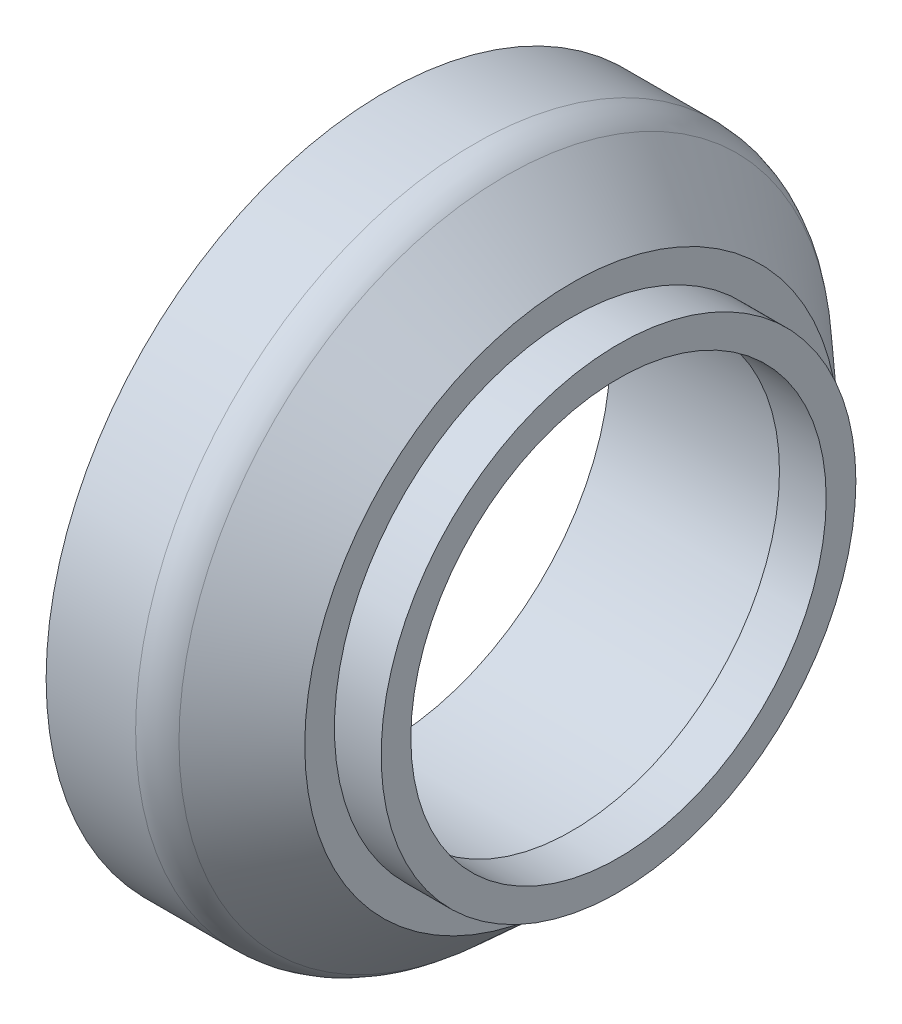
ISO-10303-21;
HEADER;
FILE_DESCRIPTION(('STEP AP214'),'2;1');
FILE_NAME('part.step','',(''),(''),'','','');
FILE_SCHEMA(('AUTOMOTIVE_DESIGN { 1 0 10303 214 1 1 1 1 }'));
ENDSEC;
DATA;
#1=APPLICATION_CONTEXT('core data for automotive mechanical design processes');
#2=APPLICATION_PROTOCOL_DEFINITION('international standard','automotive_design',2000,#1);
#3=PRODUCT_CONTEXT('',#1,'mechanical');
#4=PRODUCT('Part','Part','',(#3));
#5=PRODUCT_RELATED_PRODUCT_CATEGORY('part','',(#4));
#6=PRODUCT_DEFINITION_FORMATION('','',#4);
#7=PRODUCT_DEFINITION_CONTEXT('part definition',#1,'design');
#8=PRODUCT_DEFINITION('design','',#6,#7);
#9=PRODUCT_DEFINITION_SHAPE('','',#8);
#10=(LENGTH_UNIT() NAMED_UNIT(*) SI_UNIT(.MILLI.,.METRE.));
#11=(NAMED_UNIT(*) PLANE_ANGLE_UNIT() SI_UNIT($,.RADIAN.));
#12=(NAMED_UNIT(*) SI_UNIT($,.STERADIAN.) SOLID_ANGLE_UNIT());
#13=UNCERTAINTY_MEASURE_WITH_UNIT(LENGTH_MEASURE(1.E-05),#10,'distance_accuracy_value','');
#14=(GEOMETRIC_REPRESENTATION_CONTEXT(3) GLOBAL_UNCERTAINTY_ASSIGNED_CONTEXT((#13)) GLOBAL_UNIT_ASSIGNED_CONTEXT((#10,
#11,#12)) REPRESENTATION_CONTEXT('',''));
#15=CARTESIAN_POINT('',(0.,0.,0.));
#16=DIRECTION('',(0.,0.,1.));
#17=DIRECTION('',(1.,0.,0.));
#18=AXIS2_PLACEMENT_3D('',#15,#16,#17);
#19=CARTESIAN_POINT('',(0.,72.5,0.));
#20=DIRECTION('',(1.,0.,0.));
#21=DIRECTION('',(0.,0.,-1.));
#22=AXIS2_PLACEMENT_3D('',#19,#20,#21);
#23=PLANE('',#22);
#24=CARTESIAN_POINT('',(0.,54.1265877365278,31.2499999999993));
#25=DIRECTION('',(1.,0.,0.));
#26=DIRECTION('',(0.,0.,-1.));
#27=AXIS2_PLACEMENT_3D('',#24,#25,#26);
#28=CIRCLE('',#27,6.35000000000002);
#29=CARTESIAN_POINT('',(0.,54.1265877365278,24.8999999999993));
#30=VERTEX_POINT('',#29);
#31=EDGE_CURVE('E10',#30,#30,#28,.T.);
#32=ORIENTED_EDGE('',*,*,#31,.T.);
#33=EDGE_LOOP('',(#32));
#34=FACE_BOUND('',#33,.T.);
#35=CARTESIAN_POINT('',(0.,31.2500000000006,54.126587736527));
#36=DIRECTION('',(1.,0.,0.));
#37=DIRECTION('',(0.,0.,-1.));
#38=AXIS2_PLACEMENT_3D('',#35,#36,#37);
#39=CIRCLE('',#38,6.35);
#40=CARTESIAN_POINT('',(0.,31.2500000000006,47.776587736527));
#41=VERTEX_POINT('',#40);
#42=EDGE_CURVE('E51',#41,#41,#39,.T.);
#43=ORIENTED_EDGE('',*,*,#42,.T.);
#44=EDGE_LOOP('',(#43));
#45=FACE_BOUND('',#44,.T.);
#46=CARTESIAN_POINT('',(0.,6.54652751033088E-13,62.5));
#47=DIRECTION('',(1.,0.,0.));
#48=DIRECTION('',(0.,0.,-1.));
#49=AXIS2_PLACEMENT_3D('',#46,#47,#48);
#50=CIRCLE('',#49,6.35000000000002);
#51=CARTESIAN_POINT('',(0.,6.54652751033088E-13,56.15));
#52=VERTEX_POINT('',#51);
#53=EDGE_CURVE('E58',#52,#52,#50,.T.);
#54=ORIENTED_EDGE('',*,*,#53,.T.);
#55=EDGE_LOOP('',(#54));
#56=FACE_BOUND('',#55,.T.);
#57=CARTESIAN_POINT('',(0.,-31.2499999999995,54.1265877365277));
#58=DIRECTION('',(1.,0.,0.));
#59=DIRECTION('',(0.,0.,-1.));
#60=AXIS2_PLACEMENT_3D('',#57,#58,#59);
#61=CIRCLE('',#60,6.34999999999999);
#62=CARTESIAN_POINT('',(0.,-31.2499999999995,47.7765877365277));
#63=VERTEX_POINT('',#62);
#64=EDGE_CURVE('E66',#63,#63,#61,.T.);
#65=ORIENTED_EDGE('',*,*,#64,.T.);
#66=EDGE_LOOP('',(#65));
#67=FACE_BOUND('',#66,.T.);
#68=CARTESIAN_POINT('',(0.,-54.1265877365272,31.2500000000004));
#69=DIRECTION('',(1.,0.,0.));
#70=DIRECTION('',(0.,0.,-1.));
#71=AXIS2_PLACEMENT_3D('',#68,#69,#70);
#72=CIRCLE('',#71,6.34999999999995);
#73=CARTESIAN_POINT('',(0.,-54.1265877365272,24.9000000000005));
#74=VERTEX_POINT('',#73);
#75=EDGE_CURVE('E75',#74,#74,#72,.T.);
#76=ORIENTED_EDGE('',*,*,#75,.T.);
#77=EDGE_LOOP('',(#76));
#78=FACE_BOUND('',#77,.T.);
#79=CARTESIAN_POINT('',(0.,-62.5,0.));
#80=DIRECTION('',(1.,0.,0.));
#81=DIRECTION('',(0.,0.,-1.));
#82=AXIS2_PLACEMENT_3D('',#79,#80,#81);
#83=CIRCLE('',#82,6.35000000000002);
#84=CARTESIAN_POINT('',(0.,-62.5,-6.35000000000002));
#85=VERTEX_POINT('',#84);
#86=EDGE_CURVE('E77',#85,#85,#83,.T.);
#87=ORIENTED_EDGE('',*,*,#86,.T.);
#88=EDGE_LOOP('',(#87));
#89=FACE_BOUND('',#88,.T.);
#90=CARTESIAN_POINT('',(0.,-54.1265877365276,-31.2499999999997));
#91=DIRECTION('',(1.,0.,0.));
#92=DIRECTION('',(0.,0.,-1.));
#93=AXIS2_PLACEMENT_3D('',#90,#91,#92);
#94=CIRCLE('',#93,6.35000000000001);
#95=CARTESIAN_POINT('',(0.,-54.1265877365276,-37.5999999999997));
#96=VERTEX_POINT('',#95);
#97=EDGE_CURVE('E82',#96,#96,#94,.T.);
#98=ORIENTED_EDGE('',*,*,#97,.T.);
#99=EDGE_LOOP('',(#98));
#100=FACE_BOUND('',#99,.T.);
#101=CARTESIAN_POINT('',(0.,-31.2500000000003,-54.1265877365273));
#102=DIRECTION('',(1.,0.,0.));
#103=DIRECTION('',(0.,0.,-1.));
#104=AXIS2_PLACEMENT_3D('',#101,#102,#103);
#105=CIRCLE('',#104,6.34999999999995);
#106=CARTESIAN_POINT('',(0.,-31.2500000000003,-60.4765877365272));
#107=VERTEX_POINT('',#106);
#108=EDGE_CURVE('E89',#107,#107,#105,.T.);
#109=ORIENTED_EDGE('',*,*,#108,.T.);
#110=EDGE_LOOP('',(#109));
#111=FACE_BOUND('',#110,.T.);
#112=CARTESIAN_POINT('',(0.,-2.18217583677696E-13,-62.5));
#113=DIRECTION('',(1.,0.,0.));
#114=DIRECTION('',(0.,0.,-1.));
#115=AXIS2_PLACEMENT_3D('',#112,#113,#114);
#116=CIRCLE('',#115,6.35000000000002);
#117=CARTESIAN_POINT('',(0.,-2.18217583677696E-13,-68.85));
#118=VERTEX_POINT('',#117);
#119=EDGE_CURVE('E96',#118,#118,#116,.T.);
#120=ORIENTED_EDGE('',*,*,#119,.T.);
#121=EDGE_LOOP('',(#120));
#122=FACE_BOUND('',#121,.T.);
#123=CARTESIAN_POINT('',(0.,31.2499999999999,-54.1265877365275));
#124=DIRECTION('',(1.,0.,0.));
#125=DIRECTION('',(0.,0.,-1.));
#126=AXIS2_PLACEMENT_3D('',#123,#124,#125);
#127=CIRCLE('',#126,6.34999999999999);
#128=CARTESIAN_POINT('',(0.,31.2499999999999,-60.4765877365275));
#129=VERTEX_POINT('',#128);
#130=EDGE_CURVE('E105',#129,#129,#127,.T.);
#131=ORIENTED_EDGE('',*,*,#130,.T.);
#132=EDGE_LOOP('',(#131));
#133=FACE_BOUND('',#132,.T.);
#134=CARTESIAN_POINT('',(0.,54.1265877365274,-31.2500000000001));
#135=DIRECTION('',(1.,0.,0.));
#136=DIRECTION('',(0.,0.,-1.));
#137=AXIS2_PLACEMENT_3D('',#134,#135,#136);
#138=CIRCLE('',#137,6.35000000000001);
#139=CARTESIAN_POINT('',(0.,54.1265877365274,-37.6000000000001));
#140=VERTEX_POINT('',#139);
#141=EDGE_CURVE('E107',#140,#140,#138,.T.);
#142=ORIENTED_EDGE('',*,*,#141,.T.);
#143=EDGE_LOOP('',(#142));
#144=FACE_BOUND('',#143,.T.);
#145=CARTESIAN_POINT('',(0.,62.5,0.));
#146=DIRECTION('',(1.,0.,0.));
#147=DIRECTION('',(0.,0.,-1.));
#148=AXIS2_PLACEMENT_3D('',#145,#146,#147);
#149=CIRCLE('',#148,6.35000000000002);
#150=CARTESIAN_POINT('',(0.,62.5,-6.35000000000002));
#151=VERTEX_POINT('',#150);
#152=EDGE_CURVE('E111',#151,#151,#149,.T.);
#153=ORIENTED_EDGE('',*,*,#152,.T.);
#154=EDGE_LOOP('',(#153));
#155=FACE_BOUND('',#154,.T.);
#156=CARTESIAN_POINT('',(0.,0.,0.));
#157=DIRECTION('',(-1.,0.,0.));
#158=DIRECTION('',(0.,0.,1.));
#159=AXIS2_PLACEMENT_3D('',#156,#157,#158);
#160=CIRCLE('',#159,48.25);
#161=CARTESIAN_POINT('',(0.,0.,48.25));
#162=VERTEX_POINT('',#161);
#163=EDGE_CURVE('E130',#162,#162,#160,.T.);
#164=ORIENTED_EDGE('',*,*,#163,.F.);
#165=EDGE_LOOP('',(#164));
#166=FACE_BOUND('',#165,.T.);
#167=CARTESIAN_POINT('',(0.,0.,0.));
#168=DIRECTION('',(-1.,0.,0.));
#169=DIRECTION('',(0.,0.,1.));
#170=AXIS2_PLACEMENT_3D('',#167,#168,#169);
#171=CIRCLE('',#170,72.5);
#172=CARTESIAN_POINT('',(0.,0.,72.5));
#173=VERTEX_POINT('',#172);
#174=EDGE_CURVE('E136',#173,#173,#171,.T.);
#175=ORIENTED_EDGE('',*,*,#174,.T.);
#176=EDGE_LOOP('',(#175));
#177=FACE_BOUND('',#176,.T.);
#178=ADVANCED_FACE('F39',(#34,#45,#56,#67,#78,#89,#100,#111,#122,#133,#144,#155,#166,#177),#23,.F.);
#179=CARTESIAN_POINT('',(0.,0.,0.));
#180=DIRECTION('',(-1.,0.,0.));
#181=DIRECTION('',(0.,0.,1.));
#182=AXIS2_PLACEMENT_3D('',#179,#180,#181);
#183=CYLINDRICAL_SURFACE('',#182,48.25);
#184=CARTESIAN_POINT('',(40.,0.,0.));
#185=DIRECTION('',(-1.,0.,0.));
#186=DIRECTION('',(0.,0.,1.));
#187=AXIS2_PLACEMENT_3D('',#184,#185,#186);
#188=CIRCLE('',#187,48.25);
#189=CARTESIAN_POINT('',(40.,0.,48.25));
#190=VERTEX_POINT('',#189);
#191=EDGE_CURVE('E128',#190,#190,#188,.T.);
#192=ORIENTED_EDGE('',*,*,#191,.F.);
#193=EDGE_LOOP('',(#192));
#194=FACE_BOUND('',#193,.T.);
#195=ORIENTED_EDGE('',*,*,#163,.T.);
#196=EDGE_LOOP('',(#195));
#197=FACE_BOUND('',#196,.T.);
#198=ADVANCED_FACE('F204',(#194,#197),#183,.F.);
#199=CARTESIAN_POINT('',(40.,48.25,0.));
#200=DIRECTION('',(-1.,0.,0.));
#201=DIRECTION('',(0.,0.,1.));
#202=AXIS2_PLACEMENT_3D('',#199,#200,#201);
#203=PLANE('',#202);
#204=CARTESIAN_POINT('',(40.,0.,0.));
#205=DIRECTION('',(1.,0.,0.));
#206=DIRECTION('',(0.,0.,-1.));
#207=AXIS2_PLACEMENT_3D('',#204,#205,#206);
#208=CIRCLE('',#207,50.8);
#209=CARTESIAN_POINT('',(40.,0.,-50.8));
#210=VERTEX_POINT('',#209);
#211=EDGE_CURVE('E119',#210,#210,#208,.T.);
#212=ORIENTED_EDGE('',*,*,#211,.F.);
#213=EDGE_LOOP('',(#212));
#214=FACE_BOUND('',#213,.T.);
#215=CARTESIAN_POINT('',(40.,0.,0.));
#216=DIRECTION('',(-1.,0.,0.));
#217=DIRECTION('',(0.,0.,1.));
#218=AXIS2_PLACEMENT_3D('',#215,#216,#217);
#219=CIRCLE('',#218,57.15);
#220=CARTESIAN_POINT('',(40.,0.,57.15));
#221=VERTEX_POINT('',#220);
#222=EDGE_CURVE('E132',#221,#221,#219,.T.);
#223=ORIENTED_EDGE('',*,*,#222,.F.);
#224=EDGE_LOOP('',(#223));
#225=FACE_BOUND('',#224,.T.);
#226=ADVANCED_FACE('F211',(#214,#225),#203,.F.);
#227=CARTESIAN_POINT('',(40.,0.,0.));
#228=DIRECTION('',(-1.,0.,0.));
#229=DIRECTION('',(0.,0.,1.));
#230=AXIS2_PLACEMENT_3D('',#227,#228,#229);
#231=CONICAL_SURFACE('',#230,57.15,0.73443768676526);
#232=CARTESIAN_POINT('',(25.8550285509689,0.,0.));
#233=DIRECTION('',(1.,0.,0.));
#234=DIRECTION('',(0.,0.,-1.));
#235=AXIS2_PLACEMENT_3D('',#232,#233,#234);
#236=CIRCLE('',#235,69.922077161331);
#237=CARTESIAN_POINT('',(25.8550285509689,0.,-69.922077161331));
#238=VERTEX_POINT('',#237);
#239=EDGE_CURVE('E121',#238,#238,#236,.T.);
#240=ORIENTED_EDGE('',*,*,#239,.T.);
#241=EDGE_LOOP('',(#240));
#242=FACE_BOUND('',#241,.T.);
#243=ORIENTED_EDGE('',*,*,#222,.T.);
#244=EDGE_LOOP('',(#243));
#245=FACE_BOUND('',#244,.T.);
#246=ADVANCED_FACE('F334',(#242,#245),#231,.T.);
#247=CARTESIAN_POINT('',(0.,0.,0.));
#248=DIRECTION('',(-1.,0.,0.));
#249=DIRECTION('',(0.,0.,1.));
#250=AXIS2_PLACEMENT_3D('',#247,#248,#249);
#251=CYLINDRICAL_SURFACE('',#250,72.5);
#252=CARTESIAN_POINT('',(19.1533294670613,0.,0.));
#253=DIRECTION('',(1.,0.,0.));
#254=DIRECTION('',(0.,0.,-1.));
#255=AXIS2_PLACEMENT_3D('',#252,#253,#254);
#256=CIRCLE('',#255,72.5);
#257=CARTESIAN_POINT('',(19.1533294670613,0.,-72.5));
#258=VERTEX_POINT('',#257);
#259=EDGE_CURVE('E122',#258,#258,#256,.F.);
#260=ORIENTED_EDGE('',*,*,#259,.T.);
#261=EDGE_LOOP('',(#260));
#262=FACE_BOUND('',#261,.T.);
#263=ORIENTED_EDGE('',*,*,#174,.F.);
#264=EDGE_LOOP('',(#263));
#265=FACE_BOUND('',#264,.T.);
#266=ADVANCED_FACE('F222',(#262,#265),#251,.T.);
#267=CARTESIAN_POINT('',(19.1533294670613,0.,0.));
#268=DIRECTION('',(1.,0.,0.));
#269=DIRECTION('',(0.,0.,-1.));
#270=AXIS2_PLACEMENT_3D('',#267,#268,#269);
#271=TOROIDAL_SURFACE('',#270,62.5,10.);
#272=ORIENTED_EDGE('',*,*,#239,.F.);
#273=EDGE_LOOP('',(#272));
#274=FACE_BOUND('',#273,.T.);
#275=ORIENTED_EDGE('',*,*,#259,.F.);
#276=EDGE_LOOP('',(#275));
#277=FACE_BOUND('',#276,.T.);
#278=ADVANCED_FACE('F220',(#274,#277),#271,.T.);
#279=CARTESIAN_POINT('',(40.,0.,0.));
#280=DIRECTION('',(1.,0.,0.));
#281=DIRECTION('',(0.,0.,-1.));
#282=AXIS2_PLACEMENT_3D('',#279,#280,#281);
#283=PLANE('',#282);
#284=CARTESIAN_POINT('',(40.,0.,0.));
#285=DIRECTION('',(1.,0.,0.));
#286=DIRECTION('',(0.,0.,-1.));
#287=AXIS2_PLACEMENT_3D('',#284,#285,#286);
#288=CIRCLE('',#287,44.45);
#289=CARTESIAN_POINT('',(40.,0.,-44.45));
#290=VERTEX_POINT('',#289);
#291=EDGE_CURVE('E144',#290,#290,#288,.T.);
#292=ORIENTED_EDGE('',*,*,#291,.T.);
#293=EDGE_LOOP('',(#292));
#294=FACE_BOUND('',#293,.T.);
#295=ORIENTED_EDGE('',*,*,#191,.T.);
#296=EDGE_LOOP('',(#295));
#297=FACE_BOUND('',#296,.T.);
#298=ADVANCED_FACE('F219',(#294,#297),#283,.F.);
#299=CARTESIAN_POINT('',(50.,0.,0.));
#300=DIRECTION('',(1.,0.,0.));
#301=DIRECTION('',(0.,0.,-1.));
#302=AXIS2_PLACEMENT_3D('',#299,#300,#301);
#303=PLANE('',#302);
#304=CARTESIAN_POINT('',(50.,0.,0.));
#305=DIRECTION('',(1.,0.,0.));
#306=DIRECTION('',(0.,0.,-1.));
#307=AXIS2_PLACEMENT_3D('',#304,#305,#306);
#308=CIRCLE('',#307,50.8);
#309=CARTESIAN_POINT('',(50.,0.,-50.8));
#310=VERTEX_POINT('',#309);
#311=EDGE_CURVE('E137',#310,#310,#308,.T.);
#312=ORIENTED_EDGE('',*,*,#311,.T.);
#313=EDGE_LOOP('',(#312));
#314=FACE_BOUND('',#313,.T.);
#315=CARTESIAN_POINT('',(50.,0.,0.));
#316=DIRECTION('',(1.,0.,0.));
#317=DIRECTION('',(0.,0.,-1.));
#318=AXIS2_PLACEMENT_3D('',#315,#316,#317);
#319=CIRCLE('',#318,44.45);
#320=CARTESIAN_POINT('',(50.,0.,-44.45));
#321=VERTEX_POINT('',#320);
#322=EDGE_CURVE('E145',#321,#321,#319,.T.);
#323=ORIENTED_EDGE('',*,*,#322,.F.);
#324=EDGE_LOOP('',(#323));
#325=FACE_BOUND('',#324,.T.);
#326=ADVANCED_FACE('F356',(#314,#325),#303,.T.);
#327=CARTESIAN_POINT('',(50.,0.,0.));
#328=DIRECTION('',(-1.,0.,0.));
#329=DIRECTION('',(0.,0.,1.));
#330=AXIS2_PLACEMENT_3D('',#327,#328,#329);
#331=CYLINDRICAL_SURFACE('',#330,50.8);
#332=ORIENTED_EDGE('',*,*,#311,.F.);
#333=EDGE_LOOP('',(#332));
#334=FACE_BOUND('',#333,.T.);
#335=ORIENTED_EDGE('',*,*,#211,.T.);
#336=EDGE_LOOP('',(#335));
#337=FACE_BOUND('',#336,.T.);
#338=ADVANCED_FACE('F345',(#334,#337),#331,.T.);
#339=CARTESIAN_POINT('',(50.,0.,0.));
#340=DIRECTION('',(-1.,0.,0.));
#341=DIRECTION('',(0.,0.,1.));
#342=AXIS2_PLACEMENT_3D('',#339,#340,#341);
#343=CYLINDRICAL_SURFACE('',#342,44.45);
#344=ORIENTED_EDGE('',*,*,#322,.T.);
#345=EDGE_LOOP('',(#344));
#346=FACE_BOUND('',#345,.T.);
#347=ORIENTED_EDGE('',*,*,#291,.F.);
#348=EDGE_LOOP('',(#347));
#349=FACE_BOUND('',#348,.T.);
#350=ADVANCED_FACE('F354',(#346,#349),#343,.F.);
#351=CARTESIAN_POINT('',(19.4,62.5,0.));
#352=DIRECTION('',(-1.,0.,0.));
#353=DIRECTION('',(0.,0.,1.));
#354=AXIS2_PLACEMENT_3D('',#351,#352,#353);
#355=CYLINDRICAL_SURFACE('',#354,5.35);
#356=CARTESIAN_POINT('',(0.999999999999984,62.5,0.));
#357=DIRECTION('',(1.,0.,0.));
#358=DIRECTION('',(0.,0.,-1.));
#359=AXIS2_PLACEMENT_3D('',#356,#357,#358);
#360=CIRCLE('',#359,5.35);
#361=CARTESIAN_POINT('',(0.999999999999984,62.5,-5.35));
#362=VERTEX_POINT('',#361);
#363=EDGE_CURVE('E120',#362,#362,#360,.F.);
#364=ORIENTED_EDGE('',*,*,#363,.T.);
#365=EDGE_LOOP('',(#364));
#366=FACE_BOUND('',#365,.T.);
#367=CARTESIAN_POINT('',(19.4,62.5,0.));
#368=DIRECTION('',(-1.,0.,0.));
#369=DIRECTION('',(0.,0.,1.));
#370=AXIS2_PLACEMENT_3D('',#367,#368,#369);
#371=CIRCLE('',#370,5.35);
#372=CARTESIAN_POINT('',(19.4,62.5,5.35));
#373=VERTEX_POINT('',#372);
#374=EDGE_CURVE('E146',#373,#373,#371,.T.);
#375=ORIENTED_EDGE('',*,*,#374,.F.);
#376=EDGE_LOOP('',(#375));
#377=FACE_BOUND('',#376,.T.);
#378=ADVANCED_FACE('F362',(#366,#377),#355,.F.);
#379=CARTESIAN_POINT('',(19.4,62.5,0.));
#380=DIRECTION('',(-1.,0.,0.));
#381=DIRECTION('',(0.,0.,1.));
#382=AXIS2_PLACEMENT_3D('',#379,#380,#381);
#383=PLANE('',#382);
#384=ORIENTED_EDGE('',*,*,#374,.T.);
#385=EDGE_LOOP('',(#384));
#386=FACE_BOUND('',#385,.T.);
#387=ADVANCED_FACE('F229',(#386),#383,.T.);
#388=CARTESIAN_POINT('',(0.999999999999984,62.5,0.));
#389=DIRECTION('',(-1.,0.,0.));
#390=DIRECTION('',(0.,0.,1.));
#391=AXIS2_PLACEMENT_3D('',#388,#389,#390);
#392=CONICAL_SURFACE('',#391,5.35,0.785398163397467);
#393=ORIENTED_EDGE('',*,*,#152,.F.);
#394=EDGE_LOOP('',(#393));
#395=FACE_BOUND('',#394,.T.);
#396=ORIENTED_EDGE('',*,*,#363,.F.);
#397=EDGE_LOOP('',(#396));
#398=FACE_BOUND('',#397,.T.);
#399=ADVANCED_FACE('F221',(#395,#398),#392,.F.);
#400=CARTESIAN_POINT('',(19.4,54.1265877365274,-31.2500000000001));
#401=DIRECTION('',(-1.,0.,0.));
#402=DIRECTION('',(0.,0.,1.));
#403=AXIS2_PLACEMENT_3D('',#400,#401,#402);
#404=CYLINDRICAL_SURFACE('',#403,5.35);
#405=CARTESIAN_POINT('',(0.999999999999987,54.1265877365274,-31.2500000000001));
#406=DIRECTION('',(1.,0.,0.));
#407=DIRECTION('',(0.,0.,-1.));
#408=AXIS2_PLACEMENT_3D('',#405,#406,#407);
#409=CIRCLE('',#408,5.35);
#410=CARTESIAN_POINT('',(0.999999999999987,54.1265877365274,-36.6000000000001));
#411=VERTEX_POINT('',#410);
#412=EDGE_CURVE('E112',#411,#411,#409,.F.);
#413=ORIENTED_EDGE('',*,*,#412,.T.);
#414=EDGE_LOOP('',(#413));
#415=FACE_BOUND('',#414,.T.);
#416=CARTESIAN_POINT('',(19.4,54.1265877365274,-31.2500000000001));
#417=DIRECTION('',(-1.,0.,0.));
#418=DIRECTION('',(0.,0.500000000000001,0.866025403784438));
#419=AXIS2_PLACEMENT_3D('',#416,#417,#418);
#420=CIRCLE('',#419,5.35);
#421=CARTESIAN_POINT('',(19.4,56.8015877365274,-26.6167640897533));
#422=VERTEX_POINT('',#421);
#423=EDGE_CURVE('E153',#422,#422,#420,.T.);
#424=ORIENTED_EDGE('',*,*,#423,.F.);
#425=EDGE_LOOP('',(#424));
#426=FACE_BOUND('',#425,.T.);
#427=ADVANCED_FACE('F228',(#415,#426),#404,.F.);
#428=CARTESIAN_POINT('',(19.4,54.1265877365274,-31.2500000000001));
#429=DIRECTION('',(-1.,0.,0.));
#430=DIRECTION('',(0.,0.500000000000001,0.866025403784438));
#431=AXIS2_PLACEMENT_3D('',#428,#429,#430);
#432=PLANE('',#431);
#433=ORIENTED_EDGE('',*,*,#423,.T.);
#434=EDGE_LOOP('',(#433));
#435=FACE_BOUND('',#434,.T.);
#436=ADVANCED_FACE('F387',(#435),#432,.T.);
#437=CARTESIAN_POINT('',(19.4,54.1265877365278,31.2499999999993));
#438=DIRECTION('',(-1.,0.,0.));
#439=DIRECTION('',(0.,0.,1.));
#440=AXIS2_PLACEMENT_3D('',#437,#438,#439);
#441=CYLINDRICAL_SURFACE('',#440,5.35);
#442=CARTESIAN_POINT('',(0.999999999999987,54.1265877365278,31.2499999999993));
#443=DIRECTION('',(1.,0.,0.));
#444=DIRECTION('',(0.,0.,-1.));
#445=AXIS2_PLACEMENT_3D('',#442,#443,#444);
#446=CIRCLE('',#445,5.35);
#447=CARTESIAN_POINT('',(0.999999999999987,54.1265877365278,25.8999999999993));
#448=VERTEX_POINT('',#447);
#449=EDGE_CURVE('E50',#448,#448,#446,.F.);
#450=ORIENTED_EDGE('',*,*,#449,.T.);
#451=EDGE_LOOP('',(#450));
#452=FACE_BOUND('',#451,.T.);
#453=CARTESIAN_POINT('',(19.4,54.1265877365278,31.2499999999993));
#454=DIRECTION('',(-1.,0.,0.));
#455=DIRECTION('',(0.,-0.499999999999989,0.866025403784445));
#456=AXIS2_PLACEMENT_3D('',#453,#454,#455);
#457=CIRCLE('',#456,5.35);
#458=CARTESIAN_POINT('',(19.4,51.4515877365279,35.8832359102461));
#459=VERTEX_POINT('',#458);
#460=EDGE_CURVE('E182',#459,#459,#457,.T.);
#461=ORIENTED_EDGE('',*,*,#460,.F.);
#462=EDGE_LOOP('',(#461));
#463=FACE_BOUND('',#462,.T.);
#464=ADVANCED_FACE('F199',(#452,#463),#441,.F.);
#465=CARTESIAN_POINT('',(19.4,54.1265877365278,31.2499999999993));
#466=DIRECTION('',(-1.,0.,0.));
#467=DIRECTION('',(0.,-0.499999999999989,0.866025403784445));
#468=AXIS2_PLACEMENT_3D('',#465,#466,#467);
#469=PLANE('',#468);
#470=ORIENTED_EDGE('',*,*,#460,.T.);
#471=EDGE_LOOP('',(#470));
#472=FACE_BOUND('',#471,.T.);
#473=ADVANCED_FACE('F191',(#472),#469,.T.);
#474=CARTESIAN_POINT('',(19.4,31.2500000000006,54.126587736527));
#475=DIRECTION('',(-1.,0.,0.));
#476=DIRECTION('',(0.,0.,1.));
#477=AXIS2_PLACEMENT_3D('',#474,#475,#476);
#478=CYLINDRICAL_SURFACE('',#477,5.35);
#479=CARTESIAN_POINT('',(0.999999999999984,31.2500000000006,54.126587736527));
#480=DIRECTION('',(1.,0.,0.));
#481=DIRECTION('',(0.,0.,-1.));
#482=AXIS2_PLACEMENT_3D('',#479,#480,#481);
#483=CIRCLE('',#482,5.35);
#484=CARTESIAN_POINT('',(0.999999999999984,31.2500000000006,48.776587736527));
#485=VERTEX_POINT('',#484);
#486=EDGE_CURVE('E54',#485,#485,#483,.F.);
#487=ORIENTED_EDGE('',*,*,#486,.T.);
#488=EDGE_LOOP('',(#487));
#489=FACE_BOUND('',#488,.T.);
#490=CARTESIAN_POINT('',(19.4,31.2500000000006,54.126587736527));
#491=DIRECTION('',(-1.,0.,0.));
#492=DIRECTION('',(0.,-0.866025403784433,0.50000000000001));
#493=AXIS2_PLACEMENT_3D('',#490,#491,#492);
#494=CIRCLE('',#493,5.35);
#495=CARTESIAN_POINT('',(19.4,26.6167640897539,56.8015877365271));
#496=VERTEX_POINT('',#495);
#497=EDGE_CURVE('E161',#496,#496,#494,.T.);
#498=ORIENTED_EDGE('',*,*,#497,.F.);
#499=EDGE_LOOP('',(#498));
#500=FACE_BOUND('',#499,.T.);
#501=ADVANCED_FACE('F188',(#489,#500),#478,.F.);
#502=CARTESIAN_POINT('',(19.4,31.2500000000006,54.126587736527));
#503=DIRECTION('',(-1.,0.,0.));
#504=DIRECTION('',(0.,-0.866025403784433,0.50000000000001));
#505=AXIS2_PLACEMENT_3D('',#502,#503,#504);
#506=PLANE('',#505);
#507=ORIENTED_EDGE('',*,*,#497,.T.);
#508=EDGE_LOOP('',(#507));
#509=FACE_BOUND('',#508,.T.);
#510=ADVANCED_FACE('F190',(#509),#506,.T.);
#511=CARTESIAN_POINT('',(19.4,6.54652751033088E-13,62.5));
#512=DIRECTION('',(-1.,0.,0.));
#513=DIRECTION('',(0.,0.,1.));
#514=AXIS2_PLACEMENT_3D('',#511,#512,#513);
#515=CYLINDRICAL_SURFACE('',#514,5.35);
#516=CARTESIAN_POINT('',(0.999999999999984,6.54652751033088E-13,62.5));
#517=DIRECTION('',(1.,0.,0.));
#518=DIRECTION('',(0.,0.,-1.));
#519=AXIS2_PLACEMENT_3D('',#516,#517,#518);
#520=CIRCLE('',#519,5.35);
#521=CARTESIAN_POINT('',(0.999999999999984,6.54652751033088E-13,57.15));
#522=VERTEX_POINT('',#521);
#523=EDGE_CURVE('E62',#522,#522,#520,.F.);
#524=ORIENTED_EDGE('',*,*,#523,.T.);
#525=EDGE_LOOP('',(#524));
#526=FACE_BOUND('',#525,.T.);
#527=CARTESIAN_POINT('',(19.4,6.54652751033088E-13,62.5));
#528=DIRECTION('',(-1.,0.,0.));
#529=DIRECTION('',(0.,-1.,0.));
#530=AXIS2_PLACEMENT_3D('',#527,#528,#529);
#531=CIRCLE('',#530,5.35);
#532=CARTESIAN_POINT('',(19.4,-5.34999999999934,62.5000000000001));
#533=VERTEX_POINT('',#532);
#534=EDGE_CURVE('E160',#533,#533,#531,.T.);
#535=ORIENTED_EDGE('',*,*,#534,.F.);
#536=EDGE_LOOP('',(#535));
#537=FACE_BOUND('',#536,.T.);
#538=ADVANCED_FACE('F196',(#526,#537),#515,.F.);
#539=CARTESIAN_POINT('',(19.4,6.54652751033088E-13,62.5));
#540=DIRECTION('',(-1.,0.,0.));
#541=DIRECTION('',(0.,-1.,0.));
#542=AXIS2_PLACEMENT_3D('',#539,#540,#541);
#543=PLANE('',#542);
#544=ORIENTED_EDGE('',*,*,#534,.T.);
#545=EDGE_LOOP('',(#544));
#546=FACE_BOUND('',#545,.T.);
#547=ADVANCED_FACE('F392',(#546),#543,.T.);
#548=CARTESIAN_POINT('',(19.4,-31.2499999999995,54.1265877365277));
#549=DIRECTION('',(-1.,0.,0.));
#550=DIRECTION('',(0.,0.,1.));
#551=AXIS2_PLACEMENT_3D('',#548,#549,#550);
#552=CYLINDRICAL_SURFACE('',#551,5.35);
#553=CARTESIAN_POINT('',(0.999999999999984,-31.2499999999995,54.1265877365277));
#554=DIRECTION('',(1.,0.,0.));
#555=DIRECTION('',(0.,0.,-1.));
#556=AXIS2_PLACEMENT_3D('',#553,#554,#555);
#557=CIRCLE('',#556,5.35);
#558=CARTESIAN_POINT('',(0.999999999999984,-31.2499999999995,48.7765877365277));
#559=VERTEX_POINT('',#558);
#560=EDGE_CURVE('E67',#559,#559,#557,.F.);
#561=ORIENTED_EDGE('',*,*,#560,.T.);
#562=EDGE_LOOP('',(#561));
#563=FACE_BOUND('',#562,.T.);
#564=CARTESIAN_POINT('',(19.4,-31.2499999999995,54.1265877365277));
#565=DIRECTION('',(-1.,0.,0.));
#566=DIRECTION('',(0.,-0.866025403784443,-0.499999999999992));
#567=AXIS2_PLACEMENT_3D('',#564,#565,#566);
#568=CIRCLE('',#567,5.35);
#569=CARTESIAN_POINT('',(19.4,-35.8832359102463,51.4515877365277));
#570=VERTEX_POINT('',#569);
#571=EDGE_CURVE('E159',#570,#570,#568,.T.);
#572=ORIENTED_EDGE('',*,*,#571,.F.);
#573=EDGE_LOOP('',(#572));
#574=FACE_BOUND('',#573,.T.);
#575=ADVANCED_FACE('F400',(#563,#574),#552,.F.);
#576=CARTESIAN_POINT('',(19.4,-31.2499999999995,54.1265877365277));
#577=DIRECTION('',(-1.,0.,0.));
#578=DIRECTION('',(0.,-0.866025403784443,-0.499999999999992));
#579=AXIS2_PLACEMENT_3D('',#576,#577,#578);
#580=PLANE('',#579);
#581=ORIENTED_EDGE('',*,*,#571,.T.);
#582=EDGE_LOOP('',(#581));
#583=FACE_BOUND('',#582,.T.);
#584=ADVANCED_FACE('F402',(#583),#580,.T.);
#585=CARTESIAN_POINT('',(19.4,-54.1265877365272,31.2500000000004));
#586=DIRECTION('',(-1.,0.,0.));
#587=DIRECTION('',(0.,0.,1.));
#588=AXIS2_PLACEMENT_3D('',#585,#586,#587);
#589=CYLINDRICAL_SURFACE('',#588,5.35);
#590=CARTESIAN_POINT('',(0.999999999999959,-54.1265877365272,31.2500000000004));
#591=DIRECTION('',(1.,0.,0.));
#592=DIRECTION('',(0.,0.,-1.));
#593=AXIS2_PLACEMENT_3D('',#590,#591,#592);
#594=CIRCLE('',#593,5.35);
#595=CARTESIAN_POINT('',(0.999999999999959,-54.1265877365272,25.9000000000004));
#596=VERTEX_POINT('',#595);
#597=EDGE_CURVE('E73',#596,#596,#594,.F.);
#598=ORIENTED_EDGE('',*,*,#597,.T.);
#599=EDGE_LOOP('',(#598));
#600=FACE_BOUND('',#599,.T.);
#601=CARTESIAN_POINT('',(19.4,-54.1265877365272,31.2500000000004));
#602=DIRECTION('',(-1.,0.,0.));
#603=DIRECTION('',(0.,-0.500000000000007,-0.866025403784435));
#604=AXIS2_PLACEMENT_3D('',#601,#602,#603);
#605=CIRCLE('',#604,5.35);
#606=CARTESIAN_POINT('',(19.4,-56.8015877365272,26.6167640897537));
#607=VERTEX_POINT('',#606);
#608=EDGE_CURVE('E163',#607,#607,#605,.T.);
#609=ORIENTED_EDGE('',*,*,#608,.F.);
#610=EDGE_LOOP('',(#609));
#611=FACE_BOUND('',#610,.T.);
#612=ADVANCED_FACE('F403',(#600,#611),#589,.F.);
#613=CARTESIAN_POINT('',(19.4,-54.1265877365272,31.2500000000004));
#614=DIRECTION('',(-1.,0.,0.));
#615=DIRECTION('',(0.,-0.500000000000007,-0.866025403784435));
#616=AXIS2_PLACEMENT_3D('',#613,#614,#615);
#617=PLANE('',#616);
#618=ORIENTED_EDGE('',*,*,#608,.T.);
#619=EDGE_LOOP('',(#618));
#620=FACE_BOUND('',#619,.T.);
#621=ADVANCED_FACE('F408',(#620),#617,.T.);
#622=CARTESIAN_POINT('',(19.4,-62.5,0.));
#623=DIRECTION('',(-1.,0.,0.));
#624=DIRECTION('',(0.,0.,1.));
#625=AXIS2_PLACEMENT_3D('',#622,#623,#624);
#626=CYLINDRICAL_SURFACE('',#625,5.35);
#627=CARTESIAN_POINT('',(0.999999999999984,-62.5,0.));
#628=DIRECTION('',(1.,0.,0.));
#629=DIRECTION('',(0.,0.,-1.));
#630=AXIS2_PLACEMENT_3D('',#627,#628,#629);
#631=CIRCLE('',#630,5.35);
#632=CARTESIAN_POINT('',(0.999999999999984,-62.5,-5.35));
#633=VERTEX_POINT('',#632);
#634=EDGE_CURVE('E81',#633,#633,#631,.F.);
#635=ORIENTED_EDGE('',*,*,#634,.T.);
#636=EDGE_LOOP('',(#635));
#637=FACE_BOUND('',#636,.T.);
#638=CARTESIAN_POINT('',(19.4,-62.5,0.));
#639=DIRECTION('',(-1.,0.,0.));
#640=DIRECTION('',(0.,0.,-1.));
#641=AXIS2_PLACEMENT_3D('',#638,#639,#640);
#642=CIRCLE('',#641,5.35);
#643=CARTESIAN_POINT('',(19.4,-62.5,-5.35));
#644=VERTEX_POINT('',#643);
#645=EDGE_CURVE('E170',#644,#644,#642,.T.);
#646=ORIENTED_EDGE('',*,*,#645,.F.);
#647=EDGE_LOOP('',(#646));
#648=FACE_BOUND('',#647,.T.);
#649=ADVANCED_FACE('F413',(#637,#648),#626,.F.);
#650=CARTESIAN_POINT('',(19.4,-62.5,0.));
#651=DIRECTION('',(-1.,0.,0.));
#652=DIRECTION('',(0.,0.,-1.));
#653=AXIS2_PLACEMENT_3D('',#650,#651,#652);
#654=PLANE('',#653);
#655=ORIENTED_EDGE('',*,*,#645,.T.);
#656=EDGE_LOOP('',(#655));
#657=FACE_BOUND('',#656,.T.);
#658=ADVANCED_FACE('F417',(#657),#654,.T.);
#659=CARTESIAN_POINT('',(19.4,-54.1265877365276,-31.2499999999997));
#660=DIRECTION('',(-1.,0.,0.));
#661=DIRECTION('',(0.,0.,1.));
#662=AXIS2_PLACEMENT_3D('',#659,#660,#661);
#663=CYLINDRICAL_SURFACE('',#662,5.35);
#664=CARTESIAN_POINT('',(0.999999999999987,-54.1265877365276,-31.2499999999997));
#665=DIRECTION('',(1.,0.,0.));
#666=DIRECTION('',(0.,0.,-1.));
#667=AXIS2_PLACEMENT_3D('',#664,#665,#666);
#668=CIRCLE('',#667,5.35);
#669=CARTESIAN_POINT('',(0.999999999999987,-54.1265877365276,-36.5999999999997));
#670=VERTEX_POINT('',#669);
#671=EDGE_CURVE('E87',#670,#670,#668,.F.);
#672=ORIENTED_EDGE('',*,*,#671,.T.);
#673=EDGE_LOOP('',(#672));
#674=FACE_BOUND('',#673,.T.);
#675=CARTESIAN_POINT('',(19.4,-54.1265877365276,-31.2499999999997));
#676=DIRECTION('',(-1.,0.,0.));
#677=DIRECTION('',(0.,0.499999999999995,-0.866025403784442));
#678=AXIS2_PLACEMENT_3D('',#675,#676,#677);
#679=CIRCLE('',#678,5.35);
#680=CARTESIAN_POINT('',(19.4,-51.4515877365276,-35.8832359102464));
#681=VERTEX_POINT('',#680);
#682=EDGE_CURVE('E168',#681,#681,#679,.T.);
#683=ORIENTED_EDGE('',*,*,#682,.F.);
#684=EDGE_LOOP('',(#683));
#685=FACE_BOUND('',#684,.T.);
#686=ADVANCED_FACE('F423',(#674,#685),#663,.F.);
#687=CARTESIAN_POINT('',(19.4,-54.1265877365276,-31.2499999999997));
#688=DIRECTION('',(-1.,0.,0.));
#689=DIRECTION('',(0.,0.499999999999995,-0.866025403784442));
#690=AXIS2_PLACEMENT_3D('',#687,#688,#689);
#691=PLANE('',#690);
#692=ORIENTED_EDGE('',*,*,#682,.T.);
#693=EDGE_LOOP('',(#692));
#694=FACE_BOUND('',#693,.T.);
#695=ADVANCED_FACE('F422',(#694),#691,.T.);
#696=CARTESIAN_POINT('',(19.4,-31.2500000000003,-54.1265877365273));
#697=DIRECTION('',(-1.,0.,0.));
#698=DIRECTION('',(0.,0.,1.));
#699=AXIS2_PLACEMENT_3D('',#696,#697,#698);
#700=CYLINDRICAL_SURFACE('',#699,5.35);
#701=CARTESIAN_POINT('',(0.999999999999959,-31.2500000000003,-54.1265877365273));
#702=DIRECTION('',(1.,0.,0.));
#703=DIRECTION('',(0.,0.,-1.));
#704=AXIS2_PLACEMENT_3D('',#701,#702,#703);
#705=CIRCLE('',#704,5.35);
#706=CARTESIAN_POINT('',(0.999999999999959,-31.2500000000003,-59.4765877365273));
#707=VERTEX_POINT('',#706);
#708=EDGE_CURVE('E91',#707,#707,#705,.F.);
#709=ORIENTED_EDGE('',*,*,#708,.T.);
#710=EDGE_LOOP('',(#709));
#711=FACE_BOUND('',#710,.T.);
#712=CARTESIAN_POINT('',(19.4,-31.2500000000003,-54.1265877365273));
#713=DIRECTION('',(-1.,0.,0.));
#714=DIRECTION('',(0.,0.866025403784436,-0.500000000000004));
#715=AXIS2_PLACEMENT_3D('',#712,#713,#714);
#716=CIRCLE('',#715,5.35);
#717=CARTESIAN_POINT('',(19.4,-26.6167640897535,-56.8015877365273));
#718=VERTEX_POINT('',#717);
#719=EDGE_CURVE('E172',#718,#718,#716,.T.);
#720=ORIENTED_EDGE('',*,*,#719,.F.);
#721=EDGE_LOOP('',(#720));
#722=FACE_BOUND('',#721,.T.);
#723=ADVANCED_FACE('F427',(#711,#722),#700,.F.);
#724=CARTESIAN_POINT('',(19.4,-31.2500000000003,-54.1265877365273));
#725=DIRECTION('',(-1.,0.,0.));
#726=DIRECTION('',(0.,0.866025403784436,-0.500000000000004));
#727=AXIS2_PLACEMENT_3D('',#724,#725,#726);
#728=PLANE('',#727);
#729=ORIENTED_EDGE('',*,*,#719,.T.);
#730=EDGE_LOOP('',(#729));
#731=FACE_BOUND('',#730,.T.);
#732=ADVANCED_FACE('F433',(#731),#728,.T.);
#733=CARTESIAN_POINT('',(19.4,-2.18217583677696E-13,-62.5));
#734=DIRECTION('',(-1.,0.,0.));
#735=DIRECTION('',(0.,0.,1.));
#736=AXIS2_PLACEMENT_3D('',#733,#734,#735);
#737=CYLINDRICAL_SURFACE('',#736,5.35);
#738=CARTESIAN_POINT('',(0.999999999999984,-2.18217583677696E-13,-62.5));
#739=DIRECTION('',(1.,0.,0.));
#740=DIRECTION('',(0.,0.,-1.));
#741=AXIS2_PLACEMENT_3D('',#738,#739,#740);
#742=CIRCLE('',#741,5.35);
#743=CARTESIAN_POINT('',(0.999999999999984,-2.18217583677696E-13,-67.85));
#744=VERTEX_POINT('',#743);
#745=EDGE_CURVE('E97',#744,#744,#742,.F.);
#746=ORIENTED_EDGE('',*,*,#745,.T.);
#747=EDGE_LOOP('',(#746));
#748=FACE_BOUND('',#747,.T.);
#749=CARTESIAN_POINT('',(19.4,-2.18217583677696E-13,-62.5));
#750=DIRECTION('',(-1.,0.,0.));
#751=DIRECTION('',(0.,1.,0.));
#752=AXIS2_PLACEMENT_3D('',#749,#750,#751);
#753=CIRCLE('',#752,5.35);
#754=CARTESIAN_POINT('',(19.4,5.34999999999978,-62.5));
#755=VERTEX_POINT('',#754);
#756=EDGE_CURVE('E176',#755,#755,#753,.T.);
#757=ORIENTED_EDGE('',*,*,#756,.F.);
#758=EDGE_LOOP('',(#757));
#759=FACE_BOUND('',#758,.T.);
#760=ADVANCED_FACE('F440',(#748,#759),#737,.F.);
#761=CARTESIAN_POINT('',(19.4,-2.18217583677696E-13,-62.5));
#762=DIRECTION('',(-1.,0.,0.));
#763=DIRECTION('',(0.,1.,0.));
#764=AXIS2_PLACEMENT_3D('',#761,#762,#763);
#765=PLANE('',#764);
#766=ORIENTED_EDGE('',*,*,#756,.T.);
#767=EDGE_LOOP('',(#766));
#768=FACE_BOUND('',#767,.T.);
#769=ADVANCED_FACE('F442',(#768),#765,.T.);
#770=CARTESIAN_POINT('',(19.4,31.2499999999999,-54.1265877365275));
#771=DIRECTION('',(-1.,0.,0.));
#772=DIRECTION('',(0.,0.,1.));
#773=AXIS2_PLACEMENT_3D('',#770,#771,#772);
#774=CYLINDRICAL_SURFACE('',#773,5.35);
#775=CARTESIAN_POINT('',(0.999999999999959,31.2499999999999,-54.1265877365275));
#776=DIRECTION('',(1.,0.,0.));
#777=DIRECTION('',(0.,0.,-1.));
#778=AXIS2_PLACEMENT_3D('',#775,#776,#777);
#779=CIRCLE('',#778,5.35);
#780=CARTESIAN_POINT('',(0.999999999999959,31.2499999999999,-59.4765877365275));
#781=VERTEX_POINT('',#780);
#782=EDGE_CURVE('E104',#781,#781,#779,.F.);
#783=ORIENTED_EDGE('',*,*,#782,.T.);
#784=EDGE_LOOP('',(#783));
#785=FACE_BOUND('',#784,.T.);
#786=CARTESIAN_POINT('',(19.4,31.2499999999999,-54.1265877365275));
#787=DIRECTION('',(-1.,0.,0.));
#788=DIRECTION('',(0.,0.86602540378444,0.499999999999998));
#789=AXIS2_PLACEMENT_3D('',#786,#787,#788);
#790=CIRCLE('',#789,5.35);
#791=CARTESIAN_POINT('',(19.4,35.8832359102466,-51.4515877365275));
#792=VERTEX_POINT('',#791);
#793=EDGE_CURVE('E156',#792,#792,#790,.T.);
#794=ORIENTED_EDGE('',*,*,#793,.F.);
#795=EDGE_LOOP('',(#794));
#796=FACE_BOUND('',#795,.T.);
#797=ADVANCED_FACE('F443',(#785,#796),#774,.F.);
#798=CARTESIAN_POINT('',(19.4,31.2499999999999,-54.1265877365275));
#799=DIRECTION('',(-1.,0.,0.));
#800=DIRECTION('',(0.,0.86602540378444,0.499999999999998));
#801=AXIS2_PLACEMENT_3D('',#798,#799,#800);
#802=PLANE('',#801);
#803=ORIENTED_EDGE('',*,*,#793,.T.);
#804=EDGE_LOOP('',(#803));
#805=FACE_BOUND('',#804,.T.);
#806=ADVANCED_FACE('F239',(#805),#802,.T.);
#807=CARTESIAN_POINT('',(0.999999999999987,54.1265877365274,-31.2500000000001));
#808=DIRECTION('',(-1.,0.,0.));
#809=DIRECTION('',(0.,0.,1.));
#810=AXIS2_PLACEMENT_3D('',#807,#808,#809);
#811=CONICAL_SURFACE('',#810,5.35,0.785398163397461);
#812=ORIENTED_EDGE('',*,*,#141,.F.);
#813=EDGE_LOOP('',(#812));
#814=FACE_BOUND('',#813,.T.);
#815=ORIENTED_EDGE('',*,*,#412,.F.);
#816=EDGE_LOOP('',(#815));
#817=FACE_BOUND('',#816,.T.);
#818=ADVANCED_FACE('F235',(#814,#817),#811,.F.);
#819=CARTESIAN_POINT('',(0.999999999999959,31.2499999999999,-54.1265877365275));
#820=DIRECTION('',(-1.,0.,0.));
#821=DIRECTION('',(0.,0.,1.));
#822=AXIS2_PLACEMENT_3D('',#819,#820,#821);
#823=CONICAL_SURFACE('',#822,5.35,0.78539816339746);
#824=ORIENTED_EDGE('',*,*,#130,.F.);
#825=EDGE_LOOP('',(#824));
#826=FACE_BOUND('',#825,.T.);
#827=ORIENTED_EDGE('',*,*,#782,.F.);
#828=EDGE_LOOP('',(#827));
#829=FACE_BOUND('',#828,.T.);
#830=ADVANCED_FACE('F236',(#826,#829),#823,.F.);
#831=CARTESIAN_POINT('',(0.999999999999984,-2.18217583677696E-13,-62.5));
#832=DIRECTION('',(-1.,0.,0.));
#833=DIRECTION('',(0.,0.,1.));
#834=AXIS2_PLACEMENT_3D('',#831,#832,#833);
#835=CONICAL_SURFACE('',#834,5.35,0.785398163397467);
#836=ORIENTED_EDGE('',*,*,#119,.F.);
#837=EDGE_LOOP('',(#836));
#838=FACE_BOUND('',#837,.T.);
#839=ORIENTED_EDGE('',*,*,#745,.F.);
#840=EDGE_LOOP('',(#839));
#841=FACE_BOUND('',#840,.T.);
#842=ADVANCED_FACE('F246',(#838,#841),#835,.F.);
#843=CARTESIAN_POINT('',(0.999999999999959,-31.2500000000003,-54.1265877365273));
#844=DIRECTION('',(-1.,0.,0.));
#845=DIRECTION('',(0.,0.,1.));
#846=AXIS2_PLACEMENT_3D('',#843,#844,#845);
#847=CONICAL_SURFACE('',#846,5.35,0.785398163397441);
#848=ORIENTED_EDGE('',*,*,#108,.F.);
#849=EDGE_LOOP('',(#848));
#850=FACE_BOUND('',#849,.T.);
#851=ORIENTED_EDGE('',*,*,#708,.F.);
#852=EDGE_LOOP('',(#851));
#853=FACE_BOUND('',#852,.T.);
#854=ADVANCED_FACE('F251',(#850,#853),#847,.F.);
#855=CARTESIAN_POINT('',(0.999999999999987,-54.1265877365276,-31.2499999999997));
#856=DIRECTION('',(-1.,0.,0.));
#857=DIRECTION('',(0.,0.,1.));
#858=AXIS2_PLACEMENT_3D('',#855,#856,#857);
#859=CONICAL_SURFACE('',#858,5.35,0.785398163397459);
#860=ORIENTED_EDGE('',*,*,#97,.F.);
#861=EDGE_LOOP('',(#860));
#862=FACE_BOUND('',#861,.T.);
#863=ORIENTED_EDGE('',*,*,#671,.F.);
#864=EDGE_LOOP('',(#863));
#865=FACE_BOUND('',#864,.T.);
#866=ADVANCED_FACE('F257',(#862,#865),#859,.F.);
#867=CARTESIAN_POINT('',(0.999999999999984,-62.5,0.));
#868=DIRECTION('',(-1.,0.,0.));
#869=DIRECTION('',(0.,0.,1.));
#870=AXIS2_PLACEMENT_3D('',#867,#868,#869);
#871=CONICAL_SURFACE('',#870,5.35,0.785398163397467);
#872=ORIENTED_EDGE('',*,*,#86,.F.);
#873=EDGE_LOOP('',(#872));
#874=FACE_BOUND('',#873,.T.);
#875=ORIENTED_EDGE('',*,*,#634,.F.);
#876=EDGE_LOOP('',(#875));
#877=FACE_BOUND('',#876,.T.);
#878=ADVANCED_FACE('F270',(#874,#877),#871,.F.);
#879=CARTESIAN_POINT('',(0.999999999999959,-54.1265877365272,31.2500000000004));
#880=DIRECTION('',(-1.,0.,0.));
#881=DIRECTION('',(0.,0.,1.));
#882=AXIS2_PLACEMENT_3D('',#879,#880,#881);
#883=CONICAL_SURFACE('',#882,5.35,0.785398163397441);
#884=ORIENTED_EDGE('',*,*,#75,.F.);
#885=EDGE_LOOP('',(#884));
#886=FACE_BOUND('',#885,.T.);
#887=ORIENTED_EDGE('',*,*,#597,.F.);
#888=EDGE_LOOP('',(#887));
#889=FACE_BOUND('',#888,.T.);
#890=ADVANCED_FACE('F273',(#886,#889),#883,.F.);
#891=CARTESIAN_POINT('',(0.999999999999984,-31.2499999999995,54.1265877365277));
#892=DIRECTION('',(-1.,0.,0.));
#893=DIRECTION('',(0.,0.,1.));
#894=AXIS2_PLACEMENT_3D('',#891,#892,#893);
#895=CONICAL_SURFACE('',#894,5.35,0.785398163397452);
#896=ORIENTED_EDGE('',*,*,#64,.F.);
#897=EDGE_LOOP('',(#896));
#898=FACE_BOUND('',#897,.T.);
#899=ORIENTED_EDGE('',*,*,#560,.F.);
#900=EDGE_LOOP('',(#899));
#901=FACE_BOUND('',#900,.T.);
#902=ADVANCED_FACE('F281',(#898,#901),#895,.F.);
#903=CARTESIAN_POINT('',(0.999999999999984,6.54652751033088E-13,62.5));
#904=DIRECTION('',(-1.,0.,0.));
#905=DIRECTION('',(0.,0.,1.));
#906=AXIS2_PLACEMENT_3D('',#903,#904,#905);
#907=CONICAL_SURFACE('',#906,5.35,0.785398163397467);
#908=ORIENTED_EDGE('',*,*,#53,.F.);
#909=EDGE_LOOP('',(#908));
#910=FACE_BOUND('',#909,.T.);
#911=ORIENTED_EDGE('',*,*,#523,.F.);
#912=EDGE_LOOP('',(#911));
#913=FACE_BOUND('',#912,.T.);
#914=ADVANCED_FACE('F288',(#910,#913),#907,.F.);
#915=CARTESIAN_POINT('',(0.999999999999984,31.2500000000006,54.126587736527));
#916=DIRECTION('',(-1.,0.,0.));
#917=DIRECTION('',(0.,0.,1.));
#918=AXIS2_PLACEMENT_3D('',#915,#916,#917);
#919=CONICAL_SURFACE('',#918,5.35,0.785398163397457);
#920=ORIENTED_EDGE('',*,*,#42,.F.);
#921=EDGE_LOOP('',(#920));
#922=FACE_BOUND('',#921,.T.);
#923=ORIENTED_EDGE('',*,*,#486,.F.);
#924=EDGE_LOOP('',(#923));
#925=FACE_BOUND('',#924,.T.);
#926=ADVANCED_FACE('F294',(#922,#925),#919,.F.);
#927=CARTESIAN_POINT('',(0.999999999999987,54.1265877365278,31.2499999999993));
#928=DIRECTION('',(-1.,0.,0.));
#929=DIRECTION('',(0.,0.,1.));
#930=AXIS2_PLACEMENT_3D('',#927,#928,#929);
#931=CONICAL_SURFACE('',#930,5.35,0.785398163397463);
#932=ORIENTED_EDGE('',*,*,#31,.F.);
#933=EDGE_LOOP('',(#932));
#934=FACE_BOUND('',#933,.T.);
#935=ORIENTED_EDGE('',*,*,#449,.F.);
#936=EDGE_LOOP('',(#935));
#937=FACE_BOUND('',#936,.T.);
#938=ADVANCED_FACE('F45',(#934,#937),#931,.F.);
#939=CLOSED_SHELL('',(#178,#198,#226,#246,#266,#278,#298,#326,#338,#350,#378,#387,#399,#427,
#436,#464,#473,#501,#510,#538,#547,#575,#584,#612,#621,#649,#658,#686,#695,#723,#732,#760,#769,
#797,#806,#818,#830,#842,#854,#866,#878,#890,#902,#914,#926,#938));
#940=MANIFOLD_SOLID_BREP('B2',#939);
#941=ADVANCED_BREP_SHAPE_REPRESENTATION('',(#18,#940),#14);
#942=SHAPE_DEFINITION_REPRESENTATION(#9,#941);
ENDSEC;
END-ISO-10303-21;
